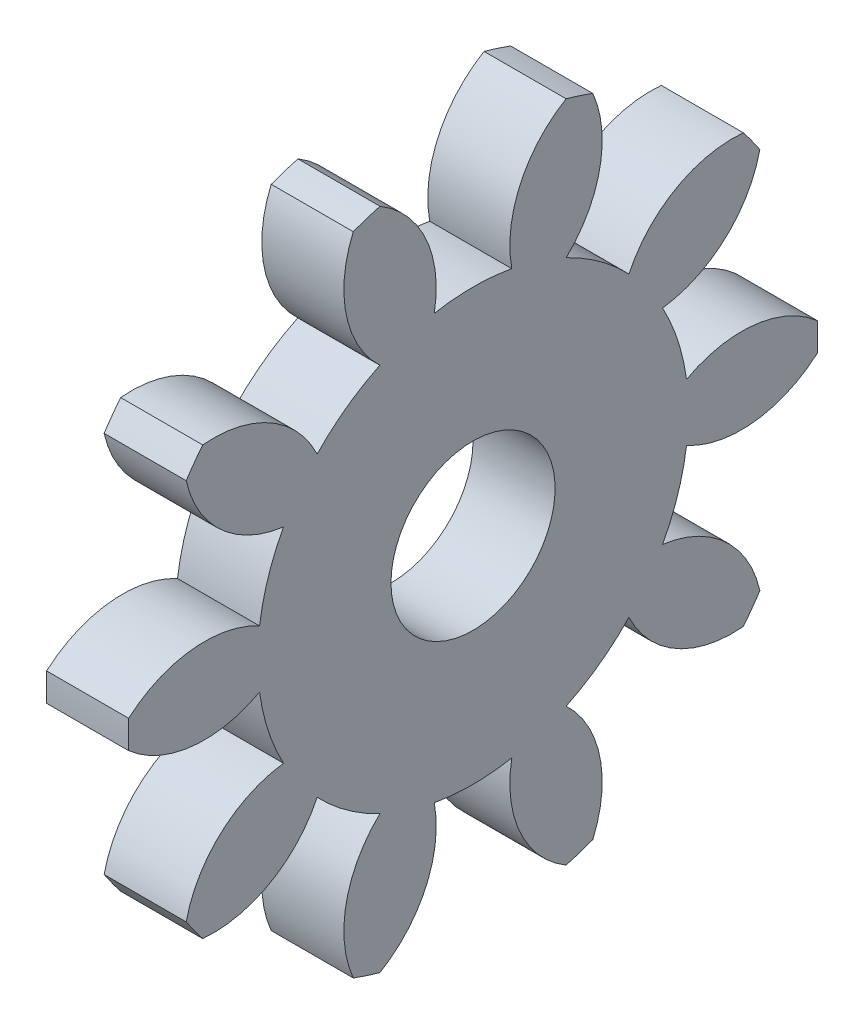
ISO-10303-21;
HEADER;
FILE_DESCRIPTION(('STEP AP214'),'2;1');
FILE_NAME('part.step','',(''),(''),'','','');
FILE_SCHEMA(('AUTOMOTIVE_DESIGN { 1 0 10303 214 1 1 1 1 }'));
ENDSEC;
DATA;
#1=APPLICATION_CONTEXT('core data for automotive mechanical design processes');
#2=APPLICATION_PROTOCOL_DEFINITION('international standard','automotive_design',2000,#1);
#3=PRODUCT_CONTEXT('',#1,'mechanical');
#4=PRODUCT('Part','Part','',(#3));
#5=PRODUCT_RELATED_PRODUCT_CATEGORY('part','',(#4));
#6=PRODUCT_DEFINITION_FORMATION('','',#4);
#7=PRODUCT_DEFINITION_CONTEXT('part definition',#1,'design');
#8=PRODUCT_DEFINITION('design','',#6,#7);
#9=PRODUCT_DEFINITION_SHAPE('','',#8);
#10=(LENGTH_UNIT() NAMED_UNIT(*) SI_UNIT(.MILLI.,.METRE.));
#11=(NAMED_UNIT(*) PLANE_ANGLE_UNIT() SI_UNIT($,.RADIAN.));
#12=(NAMED_UNIT(*) SI_UNIT($,.STERADIAN.) SOLID_ANGLE_UNIT());
#13=UNCERTAINTY_MEASURE_WITH_UNIT(LENGTH_MEASURE(1.E-05),#10,'distance_accuracy_value','');
#14=(GEOMETRIC_REPRESENTATION_CONTEXT(3) GLOBAL_UNCERTAINTY_ASSIGNED_CONTEXT((#13)) GLOBAL_UNIT_ASSIGNED_CONTEXT((#10,
#11,#12)) REPRESENTATION_CONTEXT('',''));
#15=CARTESIAN_POINT('',(0.,0.,0.));
#16=DIRECTION('',(0.,0.,1.));
#17=DIRECTION('',(1.,0.,0.));
#18=AXIS2_PLACEMENT_3D('',#15,#16,#17);
#19=CARTESIAN_POINT('',(5.,0.,0.));
#20=DIRECTION('',(-1.,0.,0.));
#21=DIRECTION('',(0.,0.,1.));
#22=AXIS2_PLACEMENT_3D('',#19,#20,#21);
#23=PLANE('',#22);
#24=CARTESIAN_POINT('',(5.,6.05558758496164,-15.8234320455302));
#25=DIRECTION('',(-1.,0.,0.));
#26=DIRECTION('',(0.,-0.587785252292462,-0.809016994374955));
#27=AXIS2_PLACEMENT_3D('',#24,#25,#26);
#28=CIRCLE('',#27,7.);
#29=CARTESIAN_POINT('',(5.,9.05584752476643,-9.49900003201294));
#30=VERTEX_POINT('',#29);
#31=CARTESIAN_POINT('',(5.,13.0254460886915,-16.4723329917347));
#32=VERTEX_POINT('',#31);
#33=EDGE_CURVE('E299',#30,#32,#28,.T.);
#34=ORIENTED_EDGE('',*,*,#33,.F.);
#35=CARTESIAN_POINT('',(5.,0.,0.));
#36=DIRECTION('',(-1.,0.,0.));
#37=DIRECTION('',(0.,-0.587785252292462,-0.809016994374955));
#38=AXIS2_PLACEMENT_3D('',#35,#36,#37);
#39=CIRCLE('',#38,13.124);
#40=CARTESIAN_POINT('',(5.,11.8324966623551,-5.67727035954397));
#41=VERTEX_POINT('',#40);
#42=EDGE_CURVE('E298',#41,#30,#39,.T.);
#43=ORIENTED_EDGE('',*,*,#42,.F.);
#44=CARTESIAN_POINT('',(5.,16.9202576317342,-0.869496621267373));
#45=DIRECTION('',(-1.,0.,0.));
#46=DIRECTION('',(0.,-0.587785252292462,-0.809016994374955));
#47=AXIS2_PLACEMENT_3D('',#44,#45,#46);
#48=CIRCLE('',#47,7.);
#49=CARTESIAN_POINT('',(5.,19.6912038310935,-7.29770454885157));
#50=VERTEX_POINT('',#49);
#51=EDGE_CURVE('E287',#50,#41,#48,.T.);
#52=ORIENTED_EDGE('',*,*,#51,.F.);
#53=CARTESIAN_POINT('',(5.,0.,0.));
#54=DIRECTION('',(-1.,0.,0.));
#55=DIRECTION('',(0.,0.,1.));
#56=AXIS2_PLACEMENT_3D('',#53,#54,#55);
#57=CIRCLE('',#56,21.);
#58=CARTESIAN_POINT('',(5.,20.2200016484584,-5.67023221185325));
#59=VERTEX_POINT('',#58);
#60=EDGE_CURVE('E522',#59,#50,#57,.T.);
#61=ORIENTED_EDGE('',*,*,#60,.F.);
#62=CARTESIAN_POINT('',(5.,14.1998532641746,-9.24204035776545));
#63=DIRECTION('',(-1.,0.,0.));
#64=DIRECTION('',(0.,0.,-1.));
#65=AXIS2_PLACEMENT_3D('',#62,#63,#64);
#66=CIRCLE('',#65,7.);
#67=CARTESIAN_POINT('',(5.,12.9097066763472,-2.3619588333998));
#68=VERTEX_POINT('',#67);
#69=EDGE_CURVE('E495',#68,#59,#66,.T.);
#70=ORIENTED_EDGE('',*,*,#69,.F.);
#71=CARTESIAN_POINT('',(5.,0.,0.));
#72=DIRECTION('',(-1.,0.,0.));
#73=DIRECTION('',(0.,0.,-1.));
#74=AXIS2_PLACEMENT_3D('',#71,#72,#73);
#75=CIRCLE('',#74,13.124);
#76=CARTESIAN_POINT('',(5.,12.9097066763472,2.3619588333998));
#77=VERTEX_POINT('',#76);
#78=EDGE_CURVE('E500',#77,#68,#75,.T.);
#79=ORIENTED_EDGE('',*,*,#78,.F.);
#80=CARTESIAN_POINT('',(5.,14.1998532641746,9.24204035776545));
#81=DIRECTION('',(-1.,0.,0.));
#82=DIRECTION('',(0.,0.,-1.));
#83=AXIS2_PLACEMENT_3D('',#80,#81,#82);
#84=CIRCLE('',#83,7.);
#85=CARTESIAN_POINT('',(5.,20.2200016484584,5.67023221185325));
#86=VERTEX_POINT('',#85);
#87=EDGE_CURVE('E497',#86,#77,#84,.T.);
#88=ORIENTED_EDGE('',*,*,#87,.F.);
#89=CARTESIAN_POINT('',(5.,19.6912038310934,7.29770454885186));
#90=VERTEX_POINT('',#89);
#91=EDGE_CURVE('E520',#90,#86,#57,.T.);
#92=ORIENTED_EDGE('',*,*,#91,.F.);
#93=CARTESIAN_POINT('',(5.,16.9202576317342,0.869496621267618));
#94=DIRECTION('',(-1.,0.,0.));
#95=DIRECTION('',(0.,0.587785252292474,-0.809016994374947));
#96=AXIS2_PLACEMENT_3D('',#93,#94,#95);
#97=CIRCLE('',#96,7.);
#98=CARTESIAN_POINT('',(5.,11.832496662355,5.67727035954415));
#99=VERTEX_POINT('',#98);
#100=EDGE_CURVE('E473',#99,#90,#97,.T.);
#101=ORIENTED_EDGE('',*,*,#100,.F.);
#102=CARTESIAN_POINT('',(5.,0.,0.));
#103=DIRECTION('',(-1.,0.,0.));
#104=DIRECTION('',(0.,0.587785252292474,-0.809016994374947));
#105=AXIS2_PLACEMENT_3D('',#102,#103,#104);
#106=CIRCLE('',#105,13.124);
#107=CARTESIAN_POINT('',(5.,9.05584752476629,9.49900003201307));
#108=VERTEX_POINT('',#107);
#109=EDGE_CURVE('E478',#108,#99,#106,.T.);
#110=ORIENTED_EDGE('',*,*,#109,.F.);
#111=CARTESIAN_POINT('',(5.,6.05558758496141,15.8234320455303));
#112=DIRECTION('',(-1.,0.,0.));
#113=DIRECTION('',(0.,0.587785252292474,-0.809016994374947));
#114=AXIS2_PLACEMENT_3D('',#111,#112,#113);
#115=CIRCLE('',#114,7.);
#116=CARTESIAN_POINT('',(5.,13.0254460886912,16.4723329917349));
#117=VERTEX_POINT('',#116);
#118=EDGE_CURVE('E475',#117,#108,#115,.T.);
#119=ORIENTED_EDGE('',*,*,#118,.F.);
#120=CARTESIAN_POINT('',(5.,11.6410354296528,17.4781662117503));
#121=VERTEX_POINT('',#120);
#122=EDGE_CURVE('E588',#121,#117,#57,.T.);
#123=ORIENTED_EDGE('',*,*,#122,.F.);
#124=CARTESIAN_POINT('',(5.,13.1776986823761,10.6489154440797));
#125=DIRECTION('',(-1.,0.,0.));
#126=DIRECTION('',(0.,0.951056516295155,-0.309016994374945));
#127=AXIS2_PLACEMENT_3D('',#124,#125,#126);
#128=CIRCLE('',#127,7.);
#129=CARTESIAN_POINT('',(5.,6.23567509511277,11.5479752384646));
#130=VERTEX_POINT('',#129);
#131=EDGE_CURVE('E451',#130,#121,#128,.T.);
#132=ORIENTED_EDGE('',*,*,#131,.F.);
#133=CARTESIAN_POINT('',(5.,0.,0.));
#134=DIRECTION('',(-1.,0.,0.));
#135=DIRECTION('',(0.,0.951056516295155,-0.309016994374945));
#136=AXIS2_PLACEMENT_3D('',#133,#134,#135);
#137=CIRCLE('',#136,13.124);
#138=CARTESIAN_POINT('',(5.,1.7429624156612,13.0077460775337));
#139=VERTEX_POINT('',#138);
#140=EDGE_CURVE('E456',#139,#130,#137,.T.);
#141=ORIENTED_EDGE('',*,*,#140,.F.);
#142=CARTESIAN_POINT('',(5.,-4.40170672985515,16.3608105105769));
#143=DIRECTION('',(-1.,0.,0.));
#144=DIRECTION('',(0.,0.951056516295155,-0.309016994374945));
#145=AXIS2_PLACEMENT_3D('',#142,#143,#144);
#146=CIRCLE('',#145,7.);
#147=CARTESIAN_POINT('',(5.,0.855612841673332,20.98256244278));
#148=VERTEX_POINT('',#147);
#149=EDGE_CURVE('E453',#148,#139,#146,.T.);
#150=ORIENTED_EDGE('',*,*,#149,.F.);
#151=CARTESIAN_POINT('',(5.,-0.855612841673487,20.98256244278));
#152=VERTEX_POINT('',#151);
#153=EDGE_CURVE('E583',#152,#148,#57,.T.);
#154=ORIENTED_EDGE('',*,*,#153,.F.);
#155=CARTESIAN_POINT('',(5.,4.40170672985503,16.3608105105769));
#156=DIRECTION('',(-1.,0.,0.));
#157=DIRECTION('',(0.,0.951056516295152,0.309016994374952));
#158=AXIS2_PLACEMENT_3D('',#155,#156,#157);
#159=CIRCLE('',#158,7.);
#160=CARTESIAN_POINT('',(5.,-1.7429624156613,13.0077460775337));
#161=VERTEX_POINT('',#160);
#162=EDGE_CURVE('E429',#161,#152,#159,.T.);
#163=ORIENTED_EDGE('',*,*,#162,.F.);
#164=CARTESIAN_POINT('',(5.,0.,0.));
#165=DIRECTION('',(-1.,0.,0.));
#166=DIRECTION('',(0.,0.951056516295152,0.309016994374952));
#167=AXIS2_PLACEMENT_3D('',#164,#165,#166);
#168=CIRCLE('',#167,13.124);
#169=CARTESIAN_POINT('',(5.,-6.23567509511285,11.5479752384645));
#170=VERTEX_POINT('',#169);
#171=EDGE_CURVE('E434',#170,#161,#168,.T.);
#172=ORIENTED_EDGE('',*,*,#171,.F.);
#173=CARTESIAN_POINT('',(5.,-13.1776986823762,10.6489154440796));
#174=DIRECTION('',(-1.,0.,0.));
#175=DIRECTION('',(0.,0.951056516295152,0.309016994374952));
#176=AXIS2_PLACEMENT_3D('',#173,#174,#175);
#177=CIRCLE('',#176,7.);
#178=CARTESIAN_POINT('',(5.,-11.6410354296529,17.4781662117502));
#179=VERTEX_POINT('',#178);
#180=EDGE_CURVE('E431',#179,#170,#177,.T.);
#181=ORIENTED_EDGE('',*,*,#180,.F.);
#182=CARTESIAN_POINT('',(5.,-13.0254460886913,16.4723329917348));
#183=VERTEX_POINT('',#182);
#184=EDGE_CURVE('E578',#183,#179,#57,.T.);
#185=ORIENTED_EDGE('',*,*,#184,.F.);
#186=CARTESIAN_POINT('',(5.,-6.05558758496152,15.8234320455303));
#187=DIRECTION('',(-1.,0.,0.));
#188=DIRECTION('',(0.,0.587785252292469,0.809016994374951));
#189=AXIS2_PLACEMENT_3D('',#186,#187,#188);
#190=CIRCLE('',#189,7.);
#191=CARTESIAN_POINT('',(5.,-9.05584752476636,9.49900003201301));
#192=VERTEX_POINT('',#191);
#193=EDGE_CURVE('E407',#192,#183,#190,.T.);
#194=ORIENTED_EDGE('',*,*,#193,.F.);
#195=CARTESIAN_POINT('',(5.,0.,0.));
#196=DIRECTION('',(-1.,0.,0.));
#197=DIRECTION('',(0.,0.587785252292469,0.809016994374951));
#198=AXIS2_PLACEMENT_3D('',#195,#196,#197);
#199=CIRCLE('',#198,13.124);
#200=CARTESIAN_POINT('',(5.,-11.832496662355,5.67727035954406));
#201=VERTEX_POINT('',#200);
#202=EDGE_CURVE('E412',#201,#192,#199,.T.);
#203=ORIENTED_EDGE('',*,*,#202,.F.);
#204=CARTESIAN_POINT('',(5.,-16.9202576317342,0.869496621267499));
#205=DIRECTION('',(-1.,0.,0.));
#206=DIRECTION('',(0.,0.587785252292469,0.809016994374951));
#207=AXIS2_PLACEMENT_3D('',#204,#205,#206);
#208=CIRCLE('',#207,7.);
#209=CARTESIAN_POINT('',(5.,-19.6912038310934,7.29770454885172));
#210=VERTEX_POINT('',#209);
#211=EDGE_CURVE('E409',#210,#201,#208,.T.);
#212=ORIENTED_EDGE('',*,*,#211,.F.);
#213=CARTESIAN_POINT('',(5.,-20.2200016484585,5.67023221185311));
#214=VERTEX_POINT('',#213);
#215=EDGE_CURVE('E573',#214,#210,#57,.T.);
#216=ORIENTED_EDGE('',*,*,#215,.F.);
#217=CARTESIAN_POINT('',(5.,-14.1998532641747,9.24204035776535));
#218=DIRECTION('',(-1.,0.,0.));
#219=DIRECTION('',(0.,0.,1.));
#220=AXIS2_PLACEMENT_3D('',#217,#218,#219);
#221=CIRCLE('',#220,7.);
#222=CARTESIAN_POINT('',(5.,-12.9097066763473,2.36195883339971));
#223=VERTEX_POINT('',#222);
#224=EDGE_CURVE('E385',#223,#214,#221,.T.);
#225=ORIENTED_EDGE('',*,*,#224,.F.);
#226=CARTESIAN_POINT('',(5.,0.,0.));
#227=DIRECTION('',(-1.,0.,0.));
#228=DIRECTION('',(0.,0.,1.));
#229=AXIS2_PLACEMENT_3D('',#226,#227,#228);
#230=CIRCLE('',#229,13.124);
#231=CARTESIAN_POINT('',(5.,-12.9097066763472,-2.36195883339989));
#232=VERTEX_POINT('',#231);
#233=EDGE_CURVE('E390',#232,#223,#230,.T.);
#234=ORIENTED_EDGE('',*,*,#233,.F.);
#235=CARTESIAN_POINT('',(5.,-14.1998532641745,-9.24204035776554));
#236=DIRECTION('',(-1.,0.,0.));
#237=DIRECTION('',(0.,0.,1.));
#238=AXIS2_PLACEMENT_3D('',#235,#236,#237);
#239=CIRCLE('',#238,7.);
#240=CARTESIAN_POINT('',(5.,-20.2200016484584,-5.67023221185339));
#241=VERTEX_POINT('',#240);
#242=EDGE_CURVE('E387',#241,#232,#239,.T.);
#243=ORIENTED_EDGE('',*,*,#242,.F.);
#244=CARTESIAN_POINT('',(5.,-19.6912038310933,-7.29770454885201));
#245=VERTEX_POINT('',#244);
#246=EDGE_CURVE('E568',#245,#241,#57,.T.);
#247=ORIENTED_EDGE('',*,*,#246,.F.);
#248=CARTESIAN_POINT('',(5.,-16.9202576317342,-0.869496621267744));
#249=DIRECTION('',(-1.,0.,0.));
#250=DIRECTION('',(0.,-0.58778525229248,0.809016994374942));
#251=AXIS2_PLACEMENT_3D('',#248,#249,#250);
#252=CIRCLE('',#251,7.);
#253=CARTESIAN_POINT('',(5.,-11.8324966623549,-5.67727035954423));
#254=VERTEX_POINT('',#253);
#255=EDGE_CURVE('E363',#254,#245,#252,.T.);
#256=ORIENTED_EDGE('',*,*,#255,.F.);
#257=CARTESIAN_POINT('',(5.,0.,0.));
#258=DIRECTION('',(-1.,0.,0.));
#259=DIRECTION('',(0.,-0.58778525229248,0.809016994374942));
#260=AXIS2_PLACEMENT_3D('',#257,#258,#259);
#261=CIRCLE('',#260,13.124);
#262=CARTESIAN_POINT('',(5.,-9.05584752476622,-9.49900003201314));
#263=VERTEX_POINT('',#262);
#264=EDGE_CURVE('E368',#263,#254,#261,.T.);
#265=ORIENTED_EDGE('',*,*,#264,.F.);
#266=CARTESIAN_POINT('',(5.,-6.05558758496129,-15.8234320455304));
#267=DIRECTION('',(-1.,0.,0.));
#268=DIRECTION('',(0.,-0.58778525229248,0.809016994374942));
#269=AXIS2_PLACEMENT_3D('',#266,#267,#268);
#270=CIRCLE('',#269,7.);
#271=CARTESIAN_POINT('',(5.,-13.0254460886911,-16.472332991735));
#272=VERTEX_POINT('',#271);
#273=EDGE_CURVE('E365',#272,#263,#270,.T.);
#274=ORIENTED_EDGE('',*,*,#273,.F.);
#275=CARTESIAN_POINT('',(5.,-11.6410354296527,-17.4781662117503));
#276=VERTEX_POINT('',#275);
#277=EDGE_CURVE('E563',#276,#272,#57,.T.);
#278=ORIENTED_EDGE('',*,*,#277,.F.);
#279=CARTESIAN_POINT('',(5.,-13.177698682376,-10.6489154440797));
#280=DIRECTION('',(-1.,0.,0.));
#281=DIRECTION('',(0.,-0.951056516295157,0.309016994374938));
#282=AXIS2_PLACEMENT_3D('',#279,#280,#281);
#283=CIRCLE('',#282,7.);
#284=CARTESIAN_POINT('',(5.,-6.23567509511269,-11.5479752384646));
#285=VERTEX_POINT('',#284);
#286=EDGE_CURVE('E341',#285,#276,#283,.T.);
#287=ORIENTED_EDGE('',*,*,#286,.F.);
#288=CARTESIAN_POINT('',(5.,0.,0.));
#289=DIRECTION('',(-1.,0.,0.));
#290=DIRECTION('',(0.,-0.951056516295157,0.309016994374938));
#291=AXIS2_PLACEMENT_3D('',#288,#289,#290);
#292=CIRCLE('',#291,13.124);
#293=CARTESIAN_POINT('',(5.,-1.74296241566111,-13.0077460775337));
#294=VERTEX_POINT('',#293);
#295=EDGE_CURVE('E346',#294,#285,#292,.T.);
#296=ORIENTED_EDGE('',*,*,#295,.F.);
#297=CARTESIAN_POINT('',(5.,4.40170672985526,-16.3608105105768));
#298=DIRECTION('',(-1.,0.,0.));
#299=DIRECTION('',(0.,-0.951056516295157,0.309016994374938));
#300=AXIS2_PLACEMENT_3D('',#297,#298,#299);
#301=CIRCLE('',#300,7.);
#302=CARTESIAN_POINT('',(5.,-0.855612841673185,-20.9825624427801));
#303=VERTEX_POINT('',#302);
#304=EDGE_CURVE('E343',#303,#294,#301,.T.);
#305=ORIENTED_EDGE('',*,*,#304,.F.);
#306=CARTESIAN_POINT('',(5.,0.855612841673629,-20.98256244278));
#307=VERTEX_POINT('',#306);
#308=EDGE_CURVE('E562',#307,#303,#57,.T.);
#309=ORIENTED_EDGE('',*,*,#308,.F.);
#310=CARTESIAN_POINT('',(5.,-4.40170672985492,-16.3608105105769));
#311=DIRECTION('',(-1.,0.,0.));
#312=DIRECTION('',(0.,-0.95105651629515,-0.309016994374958));
#313=AXIS2_PLACEMENT_3D('',#310,#311,#312);
#314=CIRCLE('',#313,7.);
#315=CARTESIAN_POINT('',(5.,1.74296241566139,-13.0077460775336));
#316=VERTEX_POINT('',#315);
#317=EDGE_CURVE('E321',#316,#307,#314,.T.);
#318=ORIENTED_EDGE('',*,*,#317,.F.);
#319=CARTESIAN_POINT('',(5.,0.,0.));
#320=DIRECTION('',(-1.,0.,0.));
#321=DIRECTION('',(0.,-0.95105651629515,-0.309016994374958));
#322=AXIS2_PLACEMENT_3D('',#319,#320,#321);
#323=CIRCLE('',#322,13.124);
#324=CARTESIAN_POINT('',(5.,6.23567509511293,-11.5479752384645));
#325=VERTEX_POINT('',#324);
#326=EDGE_CURVE('E326',#325,#316,#323,.T.);
#327=ORIENTED_EDGE('',*,*,#326,.F.);
#328=CARTESIAN_POINT('',(5.,13.1776986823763,-10.6489154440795));
#329=DIRECTION('',(-1.,0.,0.));
#330=DIRECTION('',(0.,-0.95105651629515,-0.309016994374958));
#331=AXIS2_PLACEMENT_3D('',#328,#329,#330);
#332=CIRCLE('',#331,7.);
#333=CARTESIAN_POINT('',(5.,11.641035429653,-17.4781662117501));
#334=VERTEX_POINT('',#333);
#335=EDGE_CURVE('E323',#334,#325,#332,.T.);
#336=ORIENTED_EDGE('',*,*,#335,.F.);
#337=EDGE_CURVE('E525',#32,#334,#57,.T.);
#338=ORIENTED_EDGE('',*,*,#337,.F.);
#339=EDGE_LOOP('',(#34,#43,#52,#61,#70,#79,#88,#92,#101,#110,#119,#123,#132,#141,#150,#154,#163,
#172,#181,#185,#194,#203,#212,#216,#225,#234,#243,#247,#256,#265,#274,#278,#287,#296,#305,#309,
#318,#327,#336,#338));
#340=FACE_BOUND('',#339,.T.);
#341=CARTESIAN_POINT('',(5.,0.,0.));
#342=DIRECTION('',(-1.,0.,0.));
#343=DIRECTION('',(0.,0.,1.));
#344=AXIS2_PLACEMENT_3D('',#341,#342,#343);
#345=CIRCLE('',#344,5.);
#346=CARTESIAN_POINT('',(5.,0.,5.));
#347=VERTEX_POINT('',#346);
#348=EDGE_CURVE('E316',#347,#347,#345,.F.);
#349=ORIENTED_EDGE('',*,*,#348,.F.);
#350=EDGE_LOOP('',(#349));
#351=FACE_BOUND('',#350,.T.);
#352=ADVANCED_FACE('F30',(#340,#351),#23,.F.);
#353=CARTESIAN_POINT('',(0.,0.,0.));
#354=DIRECTION('',(1.,0.,0.));
#355=DIRECTION('',(0.,0.,-1.));
#356=AXIS2_PLACEMENT_3D('',#353,#354,#355);
#357=PLANE('',#356);
#358=CARTESIAN_POINT('',(0.,6.05558758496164,-15.8234320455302));
#359=DIRECTION('',(-1.,0.,0.));
#360=DIRECTION('',(0.,-0.587785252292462,-0.809016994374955));
#361=AXIS2_PLACEMENT_3D('',#358,#359,#360);
#362=CIRCLE('',#361,7.);
#363=CARTESIAN_POINT('',(0.,9.05584752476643,-9.49900003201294));
#364=VERTEX_POINT('',#363);
#365=CARTESIAN_POINT('',(0.,13.0254460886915,-16.4723329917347));
#366=VERTEX_POINT('',#365);
#367=EDGE_CURVE('E45',#364,#366,#362,.T.);
#368=ORIENTED_EDGE('',*,*,#367,.T.);
#369=CARTESIAN_POINT('',(0.,0.,0.));
#370=DIRECTION('',(-1.,0.,0.));
#371=DIRECTION('',(0.,0.,1.));
#372=AXIS2_PLACEMENT_3D('',#369,#370,#371);
#373=CIRCLE('',#372,21.);
#374=CARTESIAN_POINT('',(0.,11.641035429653,-17.4781662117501));
#375=VERTEX_POINT('',#374);
#376=EDGE_CURVE('E521',#366,#375,#373,.T.);
#377=ORIENTED_EDGE('',*,*,#376,.T.);
#378=CARTESIAN_POINT('',(0.,13.1776986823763,-10.6489154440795));
#379=DIRECTION('',(1.,0.,0.));
#380=DIRECTION('',(0.,0.,-1.));
#381=AXIS2_PLACEMENT_3D('',#378,#379,#380);
#382=CIRCLE('',#381,7.);
#383=CARTESIAN_POINT('',(0.,6.23567509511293,-11.5479752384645));
#384=VERTEX_POINT('',#383);
#385=EDGE_CURVE('E38',#384,#375,#382,.T.);
#386=ORIENTED_EDGE('',*,*,#385,.F.);
#387=CARTESIAN_POINT('',(0.,0.,0.));
#388=DIRECTION('',(-1.,0.,0.));
#389=DIRECTION('',(0.,-0.95105651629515,-0.309016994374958));
#390=AXIS2_PLACEMENT_3D('',#387,#388,#389);
#391=CIRCLE('',#390,13.124);
#392=CARTESIAN_POINT('',(0.,1.74296241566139,-13.0077460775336));
#393=VERTEX_POINT('',#392);
#394=EDGE_CURVE('E324',#384,#393,#391,.T.);
#395=ORIENTED_EDGE('',*,*,#394,.T.);
#396=CARTESIAN_POINT('',(0.,-4.40170672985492,-16.3608105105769));
#397=DIRECTION('',(-1.,0.,0.));
#398=DIRECTION('',(0.,-0.95105651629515,-0.309016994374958));
#399=AXIS2_PLACEMENT_3D('',#396,#397,#398);
#400=CIRCLE('',#399,7.);
#401=CARTESIAN_POINT('',(0.,0.855612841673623,-20.98256244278));
#402=VERTEX_POINT('',#401);
#403=EDGE_CURVE('E53',#393,#402,#400,.T.);
#404=ORIENTED_EDGE('',*,*,#403,.T.);
#405=CARTESIAN_POINT('',(0.,-0.855612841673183,-20.9825624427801));
#406=VERTEX_POINT('',#405);
#407=EDGE_CURVE('E755',#402,#406,#373,.T.);
#408=ORIENTED_EDGE('',*,*,#407,.T.);
#409=CARTESIAN_POINT('',(0.,4.40170672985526,-16.3608105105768));
#410=DIRECTION('',(1.,0.,0.));
#411=DIRECTION('',(0.,0.,-1.));
#412=AXIS2_PLACEMENT_3D('',#409,#410,#411);
#413=CIRCLE('',#412,7.);
#414=CARTESIAN_POINT('',(0.,-1.74296241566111,-13.0077460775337));
#415=VERTEX_POINT('',#414);
#416=EDGE_CURVE('E546',#415,#406,#413,.T.);
#417=ORIENTED_EDGE('',*,*,#416,.F.);
#418=CARTESIAN_POINT('',(0.,0.,0.));
#419=DIRECTION('',(-1.,0.,0.));
#420=DIRECTION('',(0.,-0.951056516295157,0.309016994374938));
#421=AXIS2_PLACEMENT_3D('',#418,#419,#420);
#422=CIRCLE('',#421,13.124);
#423=CARTESIAN_POINT('',(0.,-6.23567509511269,-11.5479752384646));
#424=VERTEX_POINT('',#423);
#425=EDGE_CURVE('E344',#415,#424,#422,.T.);
#426=ORIENTED_EDGE('',*,*,#425,.T.);
#427=CARTESIAN_POINT('',(0.,-13.177698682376,-10.6489154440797));
#428=DIRECTION('',(-1.,0.,0.));
#429=DIRECTION('',(0.,-0.951056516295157,0.309016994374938));
#430=AXIS2_PLACEMENT_3D('',#427,#428,#429);
#431=CIRCLE('',#430,7.);
#432=CARTESIAN_POINT('',(0.,-11.6410354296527,-17.4781662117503));
#433=VERTEX_POINT('',#432);
#434=EDGE_CURVE('E340',#424,#433,#431,.T.);
#435=ORIENTED_EDGE('',*,*,#434,.T.);
#436=CARTESIAN_POINT('',(0.,-13.0254460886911,-16.472332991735));
#437=VERTEX_POINT('',#436);
#438=EDGE_CURVE('E756',#433,#437,#373,.T.);
#439=ORIENTED_EDGE('',*,*,#438,.T.);
#440=CARTESIAN_POINT('',(0.,-6.05558758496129,-15.8234320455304));
#441=DIRECTION('',(1.,0.,0.));
#442=DIRECTION('',(0.,0.,-1.));
#443=AXIS2_PLACEMENT_3D('',#440,#441,#442);
#444=CIRCLE('',#443,7.);
#445=CARTESIAN_POINT('',(0.,-9.05584752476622,-9.49900003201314));
#446=VERTEX_POINT('',#445);
#447=EDGE_CURVE('E543',#446,#437,#444,.T.);
#448=ORIENTED_EDGE('',*,*,#447,.F.);
#449=CARTESIAN_POINT('',(0.,0.,0.));
#450=DIRECTION('',(-1.,0.,0.));
#451=DIRECTION('',(0.,-0.58778525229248,0.809016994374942));
#452=AXIS2_PLACEMENT_3D('',#449,#450,#451);
#453=CIRCLE('',#452,13.124);
#454=CARTESIAN_POINT('',(0.,-11.8324966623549,-5.67727035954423));
#455=VERTEX_POINT('',#454);
#456=EDGE_CURVE('E366',#446,#455,#453,.T.);
#457=ORIENTED_EDGE('',*,*,#456,.T.);
#458=CARTESIAN_POINT('',(0.,-16.9202576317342,-0.869496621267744));
#459=DIRECTION('',(-1.,0.,0.));
#460=DIRECTION('',(0.,-0.58778525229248,0.809016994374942));
#461=AXIS2_PLACEMENT_3D('',#458,#459,#460);
#462=CIRCLE('',#461,7.);
#463=CARTESIAN_POINT('',(0.,-19.6912038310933,-7.29770454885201));
#464=VERTEX_POINT('',#463);
#465=EDGE_CURVE('E362',#455,#464,#462,.T.);
#466=ORIENTED_EDGE('',*,*,#465,.T.);
#467=CARTESIAN_POINT('',(0.,-20.2200016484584,-5.6702322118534));
#468=VERTEX_POINT('',#467);
#469=EDGE_CURVE('E759',#464,#468,#373,.T.);
#470=ORIENTED_EDGE('',*,*,#469,.T.);
#471=CARTESIAN_POINT('',(0.,-14.1998532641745,-9.24204035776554));
#472=DIRECTION('',(1.,0.,0.));
#473=DIRECTION('',(0.,0.,-1.));
#474=AXIS2_PLACEMENT_3D('',#471,#472,#473);
#475=CIRCLE('',#474,7.);
#476=CARTESIAN_POINT('',(0.,-12.9097066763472,-2.36195883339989));
#477=VERTEX_POINT('',#476);
#478=EDGE_CURVE('E540',#477,#468,#475,.T.);
#479=ORIENTED_EDGE('',*,*,#478,.F.);
#480=CARTESIAN_POINT('',(0.,0.,0.));
#481=DIRECTION('',(-1.,0.,0.));
#482=DIRECTION('',(0.,0.,1.));
#483=AXIS2_PLACEMENT_3D('',#480,#481,#482);
#484=CIRCLE('',#483,13.124);
#485=CARTESIAN_POINT('',(0.,-12.9097066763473,2.36195883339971));
#486=VERTEX_POINT('',#485);
#487=EDGE_CURVE('E388',#477,#486,#484,.T.);
#488=ORIENTED_EDGE('',*,*,#487,.T.);
#489=CARTESIAN_POINT('',(0.,-14.1998532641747,9.24204035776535));
#490=DIRECTION('',(-1.,0.,0.));
#491=DIRECTION('',(0.,0.,1.));
#492=AXIS2_PLACEMENT_3D('',#489,#490,#491);
#493=CIRCLE('',#492,7.);
#494=CARTESIAN_POINT('',(0.,-20.2200016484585,5.67023221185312));
#495=VERTEX_POINT('',#494);
#496=EDGE_CURVE('E384',#486,#495,#493,.T.);
#497=ORIENTED_EDGE('',*,*,#496,.T.);
#498=CARTESIAN_POINT('',(0.,-19.6912038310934,7.29770454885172));
#499=VERTEX_POINT('',#498);
#500=EDGE_CURVE('E762',#495,#499,#373,.T.);
#501=ORIENTED_EDGE('',*,*,#500,.T.);
#502=CARTESIAN_POINT('',(0.,-16.9202576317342,0.869496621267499));
#503=DIRECTION('',(1.,0.,0.));
#504=DIRECTION('',(0.,0.,-1.));
#505=AXIS2_PLACEMENT_3D('',#502,#503,#504);
#506=CIRCLE('',#505,7.);
#507=CARTESIAN_POINT('',(0.,-11.832496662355,5.67727035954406));
#508=VERTEX_POINT('',#507);
#509=EDGE_CURVE('E537',#508,#499,#506,.T.);
#510=ORIENTED_EDGE('',*,*,#509,.F.);
#511=CARTESIAN_POINT('',(0.,0.,0.));
#512=DIRECTION('',(-1.,0.,0.));
#513=DIRECTION('',(0.,0.587785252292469,0.809016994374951));
#514=AXIS2_PLACEMENT_3D('',#511,#512,#513);
#515=CIRCLE('',#514,13.124);
#516=CARTESIAN_POINT('',(0.,-9.05584752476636,9.49900003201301));
#517=VERTEX_POINT('',#516);
#518=EDGE_CURVE('E410',#508,#517,#515,.T.);
#519=ORIENTED_EDGE('',*,*,#518,.T.);
#520=CARTESIAN_POINT('',(0.,-6.05558758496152,15.8234320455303));
#521=DIRECTION('',(-1.,0.,0.));
#522=DIRECTION('',(0.,0.587785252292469,0.809016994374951));
#523=AXIS2_PLACEMENT_3D('',#520,#521,#522);
#524=CIRCLE('',#523,7.);
#525=CARTESIAN_POINT('',(0.,-13.0254460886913,16.4723329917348));
#526=VERTEX_POINT('',#525);
#527=EDGE_CURVE('E406',#517,#526,#524,.T.);
#528=ORIENTED_EDGE('',*,*,#527,.T.);
#529=CARTESIAN_POINT('',(0.,-11.6410354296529,17.4781662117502));
#530=VERTEX_POINT('',#529);
#531=EDGE_CURVE('E765',#526,#530,#373,.T.);
#532=ORIENTED_EDGE('',*,*,#531,.T.);
#533=CARTESIAN_POINT('',(0.,-13.1776986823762,10.6489154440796));
#534=DIRECTION('',(1.,0.,0.));
#535=DIRECTION('',(0.,0.,-1.));
#536=AXIS2_PLACEMENT_3D('',#533,#534,#535);
#537=CIRCLE('',#536,7.);
#538=CARTESIAN_POINT('',(0.,-6.23567509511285,11.5479752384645));
#539=VERTEX_POINT('',#538);
#540=EDGE_CURVE('E534',#539,#530,#537,.T.);
#541=ORIENTED_EDGE('',*,*,#540,.F.);
#542=CARTESIAN_POINT('',(0.,0.,0.));
#543=DIRECTION('',(-1.,0.,0.));
#544=DIRECTION('',(0.,0.951056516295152,0.309016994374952));
#545=AXIS2_PLACEMENT_3D('',#542,#543,#544);
#546=CIRCLE('',#545,13.124);
#547=CARTESIAN_POINT('',(0.,-1.74296241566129,13.0077460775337));
#548=VERTEX_POINT('',#547);
#549=EDGE_CURVE('E432',#539,#548,#546,.T.);
#550=ORIENTED_EDGE('',*,*,#549,.T.);
#551=CARTESIAN_POINT('',(0.,4.40170672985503,16.3608105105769));
#552=DIRECTION('',(-1.,0.,0.));
#553=DIRECTION('',(0.,0.951056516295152,0.309016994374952));
#554=AXIS2_PLACEMENT_3D('',#551,#552,#553);
#555=CIRCLE('',#554,7.);
#556=CARTESIAN_POINT('',(0.,-0.85561284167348,20.98256244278));
#557=VERTEX_POINT('',#556);
#558=EDGE_CURVE('E428',#548,#557,#555,.T.);
#559=ORIENTED_EDGE('',*,*,#558,.T.);
#560=CARTESIAN_POINT('',(0.,0.855612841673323,20.9825624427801));
#561=VERTEX_POINT('',#560);
#562=EDGE_CURVE('E768',#557,#561,#373,.T.);
#563=ORIENTED_EDGE('',*,*,#562,.T.);
#564=CARTESIAN_POINT('',(0.,-4.40170672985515,16.3608105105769));
#565=DIRECTION('',(1.,0.,0.));
#566=DIRECTION('',(0.,0.,-1.));
#567=AXIS2_PLACEMENT_3D('',#564,#565,#566);
#568=CIRCLE('',#567,7.);
#569=CARTESIAN_POINT('',(0.,1.7429624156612,13.0077460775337));
#570=VERTEX_POINT('',#569);
#571=EDGE_CURVE('E531',#570,#561,#568,.T.);
#572=ORIENTED_EDGE('',*,*,#571,.F.);
#573=CARTESIAN_POINT('',(0.,0.,0.));
#574=DIRECTION('',(-1.,0.,0.));
#575=DIRECTION('',(0.,0.951056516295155,-0.309016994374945));
#576=AXIS2_PLACEMENT_3D('',#573,#574,#575);
#577=CIRCLE('',#576,13.124);
#578=CARTESIAN_POINT('',(0.,6.23567509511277,11.5479752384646));
#579=VERTEX_POINT('',#578);
#580=EDGE_CURVE('E454',#570,#579,#577,.T.);
#581=ORIENTED_EDGE('',*,*,#580,.T.);
#582=CARTESIAN_POINT('',(0.,13.1776986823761,10.6489154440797));
#583=DIRECTION('',(-1.,0.,0.));
#584=DIRECTION('',(0.,0.951056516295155,-0.309016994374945));
#585=AXIS2_PLACEMENT_3D('',#582,#583,#584);
#586=CIRCLE('',#585,7.);
#587=CARTESIAN_POINT('',(0.,11.6410354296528,17.4781662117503));
#588=VERTEX_POINT('',#587);
#589=EDGE_CURVE('E450',#579,#588,#586,.T.);
#590=ORIENTED_EDGE('',*,*,#589,.T.);
#591=CARTESIAN_POINT('',(0.,13.0254460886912,16.4723329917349));
#592=VERTEX_POINT('',#591);
#593=EDGE_CURVE('E771',#588,#592,#373,.T.);
#594=ORIENTED_EDGE('',*,*,#593,.T.);
#595=CARTESIAN_POINT('',(0.,6.05558758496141,15.8234320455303));
#596=DIRECTION('',(1.,0.,0.));
#597=DIRECTION('',(0.,0.,-1.));
#598=AXIS2_PLACEMENT_3D('',#595,#596,#597);
#599=CIRCLE('',#598,7.);
#600=CARTESIAN_POINT('',(0.,9.05584752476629,9.49900003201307));
#601=VERTEX_POINT('',#600);
#602=EDGE_CURVE('E528',#601,#592,#599,.T.);
#603=ORIENTED_EDGE('',*,*,#602,.F.);
#604=CARTESIAN_POINT('',(0.,0.,0.));
#605=DIRECTION('',(-1.,0.,0.));
#606=DIRECTION('',(0.,0.587785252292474,-0.809016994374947));
#607=AXIS2_PLACEMENT_3D('',#604,#605,#606);
#608=CIRCLE('',#607,13.124);
#609=CARTESIAN_POINT('',(0.,11.832496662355,5.67727035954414));
#610=VERTEX_POINT('',#609);
#611=EDGE_CURVE('E476',#601,#610,#608,.T.);
#612=ORIENTED_EDGE('',*,*,#611,.T.);
#613=CARTESIAN_POINT('',(0.,16.9202576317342,0.869496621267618));
#614=DIRECTION('',(-1.,0.,0.));
#615=DIRECTION('',(0.,0.587785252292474,-0.809016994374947));
#616=AXIS2_PLACEMENT_3D('',#613,#614,#615);
#617=CIRCLE('',#616,7.);
#618=CARTESIAN_POINT('',(0.,19.6912038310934,7.29770454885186));
#619=VERTEX_POINT('',#618);
#620=EDGE_CURVE('E472',#610,#619,#617,.T.);
#621=ORIENTED_EDGE('',*,*,#620,.T.);
#622=CARTESIAN_POINT('',(0.,20.2200016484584,5.67023221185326));
#623=VERTEX_POINT('',#622);
#624=EDGE_CURVE('E516',#619,#623,#373,.T.);
#625=ORIENTED_EDGE('',*,*,#624,.T.);
#626=CARTESIAN_POINT('',(0.,14.1998532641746,9.24204035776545));
#627=DIRECTION('',(1.,0.,0.));
#628=DIRECTION('',(0.,0.,-1.));
#629=AXIS2_PLACEMENT_3D('',#626,#627,#628);
#630=CIRCLE('',#629,7.);
#631=CARTESIAN_POINT('',(0.,12.9097066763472,2.3619588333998));
#632=VERTEX_POINT('',#631);
#633=EDGE_CURVE('E524',#632,#623,#630,.T.);
#634=ORIENTED_EDGE('',*,*,#633,.F.);
#635=CARTESIAN_POINT('',(0.,0.,0.));
#636=DIRECTION('',(-1.,0.,0.));
#637=DIRECTION('',(0.,0.,-1.));
#638=AXIS2_PLACEMENT_3D('',#635,#636,#637);
#639=CIRCLE('',#638,13.124);
#640=CARTESIAN_POINT('',(0.,12.9097066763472,-2.3619588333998));
#641=VERTEX_POINT('',#640);
#642=EDGE_CURVE('E498',#632,#641,#639,.T.);
#643=ORIENTED_EDGE('',*,*,#642,.T.);
#644=CARTESIAN_POINT('',(0.,14.1998532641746,-9.24204035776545));
#645=DIRECTION('',(-1.,0.,0.));
#646=DIRECTION('',(0.,0.,-1.));
#647=AXIS2_PLACEMENT_3D('',#644,#645,#646);
#648=CIRCLE('',#647,7.);
#649=CARTESIAN_POINT('',(0.,20.2200016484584,-5.67023221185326));
#650=VERTEX_POINT('',#649);
#651=EDGE_CURVE('E494',#641,#650,#648,.T.);
#652=ORIENTED_EDGE('',*,*,#651,.T.);
#653=CARTESIAN_POINT('',(0.,19.6912038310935,-7.29770454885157));
#654=VERTEX_POINT('',#653);
#655=EDGE_CURVE('E517',#650,#654,#373,.T.);
#656=ORIENTED_EDGE('',*,*,#655,.T.);
#657=CARTESIAN_POINT('',(0.,16.9202576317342,-0.869496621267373));
#658=DIRECTION('',(1.,0.,0.));
#659=DIRECTION('',(0.,0.,-1.));
#660=AXIS2_PLACEMENT_3D('',#657,#658,#659);
#661=CIRCLE('',#660,7.);
#662=CARTESIAN_POINT('',(0.,11.8324966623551,-5.67727035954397));
#663=VERTEX_POINT('',#662);
#664=EDGE_CURVE('E11',#663,#654,#661,.T.);
#665=ORIENTED_EDGE('',*,*,#664,.F.);
#666=CARTESIAN_POINT('',(0.,0.,0.));
#667=DIRECTION('',(-1.,0.,0.));
#668=DIRECTION('',(0.,-0.587785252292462,-0.809016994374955));
#669=AXIS2_PLACEMENT_3D('',#666,#667,#668);
#670=CIRCLE('',#669,13.124);
#671=EDGE_CURVE('E304',#663,#364,#670,.T.);
#672=ORIENTED_EDGE('',*,*,#671,.T.);
#673=EDGE_LOOP('',(#368,#377,#386,#395,#404,#408,#417,#426,#435,#439,#448,#457,#466,#470,#479,
#488,#497,#501,#510,#519,#528,#532,#541,#550,#559,#563,#572,#581,#590,#594,#603,#612,#621,#625,
#634,#643,#652,#656,#665,#672));
#674=FACE_BOUND('',#673,.T.);
#675=CARTESIAN_POINT('',(0.,0.,0.));
#676=DIRECTION('',(1.,0.,0.));
#677=DIRECTION('',(0.,0.,-1.));
#678=AXIS2_PLACEMENT_3D('',#675,#676,#677);
#679=CIRCLE('',#678,5.);
#680=CARTESIAN_POINT('',(0.,0.,-5.));
#681=VERTEX_POINT('',#680);
#682=EDGE_CURVE('E33',#681,#681,#679,.F.);
#683=ORIENTED_EDGE('',*,*,#682,.F.);
#684=EDGE_LOOP('',(#683));
#685=FACE_BOUND('',#684,.T.);
#686=ADVANCED_FACE('F619',(#674,#685),#357,.F.);
#687=CARTESIAN_POINT('',(-10.,0.,0.));
#688=DIRECTION('',(-1.,0.,0.));
#689=DIRECTION('',(0.,0.,1.));
#690=AXIS2_PLACEMENT_3D('',#687,#688,#689);
#691=CYLINDRICAL_SURFACE('',#690,21.);
#692=DIRECTION('',(-1.,0.,0.));
#693=VECTOR('',#692,1.);
#694=CARTESIAN_POINT('',(2.5,13.0254460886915,-16.4723329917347));
#695=LINE('',#694,#693);
#696=EDGE_CURVE('E319',#32,#366,#695,.T.);
#697=ORIENTED_EDGE('',*,*,#696,.F.);
#698=ORIENTED_EDGE('',*,*,#337,.T.);
#699=DIRECTION('',(-1.,0.,0.));
#700=VECTOR('',#699,1.);
#701=CARTESIAN_POINT('',(2.5,11.641035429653,-17.4781662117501));
#702=LINE('',#701,#700);
#703=EDGE_CURVE('E335',#375,#334,#702,.F.);
#704=ORIENTED_EDGE('',*,*,#703,.F.);
#705=ORIENTED_EDGE('',*,*,#376,.F.);
#706=EDGE_LOOP('',(#697,#698,#704,#705));
#707=FACE_BOUND('',#706,.T.);
#708=ADVANCED_FACE('F561',(#707),#691,.T.);
#709=DIRECTION('',(-1.,0.,0.));
#710=VECTOR('',#709,1.);
#711=CARTESIAN_POINT('',(2.5,19.6912038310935,-7.29770454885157));
#712=LINE('',#711,#710);
#713=EDGE_CURVE('E293',#654,#50,#712,.F.);
#714=ORIENTED_EDGE('',*,*,#713,.F.);
#715=ORIENTED_EDGE('',*,*,#655,.F.);
#716=DIRECTION('',(-1.,0.,0.));
#717=VECTOR('',#716,1.);
#718=CARTESIAN_POINT('',(2.5,20.2200016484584,-5.67023221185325));
#719=LINE('',#718,#717);
#720=EDGE_CURVE('E514',#59,#650,#719,.T.);
#721=ORIENTED_EDGE('',*,*,#720,.F.);
#722=ORIENTED_EDGE('',*,*,#60,.T.);
#723=EDGE_LOOP('',(#714,#715,#721,#722));
#724=FACE_BOUND('',#723,.T.);
#725=ADVANCED_FACE('F622',(#724),#691,.T.);
#726=DIRECTION('',(-1.,0.,0.));
#727=VECTOR('',#726,1.);
#728=CARTESIAN_POINT('',(2.5,0.855612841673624,-20.98256244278));
#729=LINE('',#728,#727);
#730=EDGE_CURVE('E338',#307,#402,#729,.T.);
#731=ORIENTED_EDGE('',*,*,#730,.F.);
#732=ORIENTED_EDGE('',*,*,#308,.T.);
#733=DIRECTION('',(-1.,0.,0.));
#734=VECTOR('',#733,1.);
#735=CARTESIAN_POINT('',(2.5,-0.855612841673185,-20.9825624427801));
#736=LINE('',#735,#734);
#737=EDGE_CURVE('E357',#406,#303,#736,.F.);
#738=ORIENTED_EDGE('',*,*,#737,.F.);
#739=ORIENTED_EDGE('',*,*,#407,.F.);
#740=EDGE_LOOP('',(#731,#732,#738,#739));
#741=FACE_BOUND('',#740,.T.);
#742=ADVANCED_FACE('F624',(#741),#691,.T.);
#743=DIRECTION('',(-1.,0.,0.));
#744=VECTOR('',#743,1.);
#745=CARTESIAN_POINT('',(2.5,-11.6410354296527,-17.4781662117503));
#746=LINE('',#745,#744);
#747=EDGE_CURVE('E360',#276,#433,#746,.T.);
#748=ORIENTED_EDGE('',*,*,#747,.F.);
#749=ORIENTED_EDGE('',*,*,#277,.T.);
#750=DIRECTION('',(-1.,0.,0.));
#751=VECTOR('',#750,1.);
#752=CARTESIAN_POINT('',(2.5,-13.0254460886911,-16.472332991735));
#753=LINE('',#752,#751);
#754=EDGE_CURVE('E379',#437,#272,#753,.F.);
#755=ORIENTED_EDGE('',*,*,#754,.F.);
#756=ORIENTED_EDGE('',*,*,#438,.F.);
#757=EDGE_LOOP('',(#748,#749,#755,#756));
#758=FACE_BOUND('',#757,.T.);
#759=ADVANCED_FACE('F629',(#758),#691,.T.);
#760=DIRECTION('',(-1.,0.,0.));
#761=VECTOR('',#760,1.);
#762=CARTESIAN_POINT('',(2.5,-19.6912038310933,-7.29770454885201));
#763=LINE('',#762,#761);
#764=EDGE_CURVE('E382',#245,#464,#763,.T.);
#765=ORIENTED_EDGE('',*,*,#764,.F.);
#766=ORIENTED_EDGE('',*,*,#246,.T.);
#767=DIRECTION('',(-1.,0.,0.));
#768=VECTOR('',#767,1.);
#769=CARTESIAN_POINT('',(2.5,-20.2200016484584,-5.6702322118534));
#770=LINE('',#769,#768);
#771=EDGE_CURVE('E401',#468,#241,#770,.F.);
#772=ORIENTED_EDGE('',*,*,#771,.F.);
#773=ORIENTED_EDGE('',*,*,#469,.F.);
#774=EDGE_LOOP('',(#765,#766,#772,#773));
#775=FACE_BOUND('',#774,.T.);
#776=ADVANCED_FACE('F810',(#775),#691,.T.);
#777=DIRECTION('',(-1.,0.,0.));
#778=VECTOR('',#777,1.);
#779=CARTESIAN_POINT('',(2.5,-20.2200016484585,5.67023221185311));
#780=LINE('',#779,#778);
#781=EDGE_CURVE('E404',#214,#495,#780,.T.);
#782=ORIENTED_EDGE('',*,*,#781,.F.);
#783=ORIENTED_EDGE('',*,*,#215,.T.);
#784=DIRECTION('',(-1.,0.,0.));
#785=VECTOR('',#784,1.);
#786=CARTESIAN_POINT('',(2.5,-19.6912038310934,7.29770454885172));
#787=LINE('',#786,#785);
#788=EDGE_CURVE('E423',#499,#210,#787,.F.);
#789=ORIENTED_EDGE('',*,*,#788,.F.);
#790=ORIENTED_EDGE('',*,*,#500,.F.);
#791=EDGE_LOOP('',(#782,#783,#789,#790));
#792=FACE_BOUND('',#791,.T.);
#793=ADVANCED_FACE('F803',(#792),#691,.T.);
#794=DIRECTION('',(-1.,0.,0.));
#795=VECTOR('',#794,1.);
#796=CARTESIAN_POINT('',(2.5,-13.0254460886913,16.4723329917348));
#797=LINE('',#796,#795);
#798=EDGE_CURVE('E426',#183,#526,#797,.T.);
#799=ORIENTED_EDGE('',*,*,#798,.F.);
#800=ORIENTED_EDGE('',*,*,#184,.T.);
#801=DIRECTION('',(-1.,0.,0.));
#802=VECTOR('',#801,1.);
#803=CARTESIAN_POINT('',(2.5,-11.6410354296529,17.4781662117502));
#804=LINE('',#803,#802);
#805=EDGE_CURVE('E445',#530,#179,#804,.F.);
#806=ORIENTED_EDGE('',*,*,#805,.F.);
#807=ORIENTED_EDGE('',*,*,#531,.F.);
#808=EDGE_LOOP('',(#799,#800,#806,#807));
#809=FACE_BOUND('',#808,.T.);
#810=ADVANCED_FACE('F796',(#809),#691,.T.);
#811=DIRECTION('',(-1.,0.,0.));
#812=VECTOR('',#811,1.);
#813=CARTESIAN_POINT('',(2.5,-0.855612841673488,20.98256244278));
#814=LINE('',#813,#812);
#815=EDGE_CURVE('E448',#152,#557,#814,.T.);
#816=ORIENTED_EDGE('',*,*,#815,.F.);
#817=ORIENTED_EDGE('',*,*,#153,.T.);
#818=DIRECTION('',(-1.,0.,0.));
#819=VECTOR('',#818,1.);
#820=CARTESIAN_POINT('',(2.5,0.855612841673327,20.98256244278));
#821=LINE('',#820,#819);
#822=EDGE_CURVE('E467',#561,#148,#821,.F.);
#823=ORIENTED_EDGE('',*,*,#822,.F.);
#824=ORIENTED_EDGE('',*,*,#562,.F.);
#825=EDGE_LOOP('',(#816,#817,#823,#824));
#826=FACE_BOUND('',#825,.T.);
#827=ADVANCED_FACE('F789',(#826),#691,.T.);
#828=DIRECTION('',(-1.,0.,0.));
#829=VECTOR('',#828,1.);
#830=CARTESIAN_POINT('',(2.5,11.6410354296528,17.4781662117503));
#831=LINE('',#830,#829);
#832=EDGE_CURVE('E470',#121,#588,#831,.T.);
#833=ORIENTED_EDGE('',*,*,#832,.F.);
#834=ORIENTED_EDGE('',*,*,#122,.T.);
#835=DIRECTION('',(-1.,0.,0.));
#836=VECTOR('',#835,1.);
#837=CARTESIAN_POINT('',(2.5,13.0254460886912,16.4723329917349));
#838=LINE('',#837,#836);
#839=EDGE_CURVE('E489',#592,#117,#838,.F.);
#840=ORIENTED_EDGE('',*,*,#839,.F.);
#841=ORIENTED_EDGE('',*,*,#593,.F.);
#842=EDGE_LOOP('',(#833,#834,#840,#841));
#843=FACE_BOUND('',#842,.T.);
#844=ADVANCED_FACE('F782',(#843),#691,.T.);
#845=DIRECTION('',(-1.,0.,0.));
#846=VECTOR('',#845,1.);
#847=CARTESIAN_POINT('',(2.5,19.6912038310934,7.29770454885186));
#848=LINE('',#847,#846);
#849=EDGE_CURVE('E492',#90,#619,#848,.T.);
#850=ORIENTED_EDGE('',*,*,#849,.F.);
#851=ORIENTED_EDGE('',*,*,#91,.T.);
#852=DIRECTION('',(-1.,0.,0.));
#853=VECTOR('',#852,1.);
#854=CARTESIAN_POINT('',(2.5,20.2200016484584,5.67023221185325));
#855=LINE('',#854,#853);
#856=EDGE_CURVE('E511',#623,#86,#855,.F.);
#857=ORIENTED_EDGE('',*,*,#856,.F.);
#858=ORIENTED_EDGE('',*,*,#624,.F.);
#859=EDGE_LOOP('',(#850,#851,#857,#858));
#860=FACE_BOUND('',#859,.T.);
#861=ADVANCED_FACE('F601',(#860),#691,.T.);
#862=CARTESIAN_POINT('',(5.,14.1998532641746,-9.24204035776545));
#863=DIRECTION('',(-1.,0.,0.));
#864=DIRECTION('',(0.,0.,1.));
#865=AXIS2_PLACEMENT_3D('',#862,#863,#864);
#866=CYLINDRICAL_SURFACE('',#865,7.);
#867=ORIENTED_EDGE('',*,*,#720,.T.);
#868=ORIENTED_EDGE('',*,*,#651,.F.);
#869=DIRECTION('',(-1.,0.,0.));
#870=VECTOR('',#869,1.);
#871=CARTESIAN_POINT('',(5.,12.9097066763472,-2.3619588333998));
#872=LINE('',#871,#870);
#873=EDGE_CURVE('E502',#68,#641,#872,.T.);
#874=ORIENTED_EDGE('',*,*,#873,.F.);
#875=ORIENTED_EDGE('',*,*,#69,.T.);
#876=EDGE_LOOP('',(#867,#868,#874,#875));
#877=FACE_BOUND('',#876,.T.);
#878=ADVANCED_FACE('F616',(#877),#866,.T.);
#879=CARTESIAN_POINT('',(5.,14.1998532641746,9.24204035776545));
#880=DIRECTION('',(-1.,0.,0.));
#881=DIRECTION('',(0.,0.,1.));
#882=AXIS2_PLACEMENT_3D('',#879,#880,#881);
#883=CYLINDRICAL_SURFACE('',#882,7.);
#884=ORIENTED_EDGE('',*,*,#856,.T.);
#885=ORIENTED_EDGE('',*,*,#87,.T.);
#886=DIRECTION('',(-1.,0.,0.));
#887=VECTOR('',#886,1.);
#888=CARTESIAN_POINT('',(5.,12.9097066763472,2.3619588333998));
#889=LINE('',#888,#887);
#890=EDGE_CURVE('E509',#77,#632,#889,.T.);
#891=ORIENTED_EDGE('',*,*,#890,.T.);
#892=ORIENTED_EDGE('',*,*,#633,.T.);
#893=EDGE_LOOP('',(#884,#885,#891,#892));
#894=FACE_BOUND('',#893,.T.);
#895=ADVANCED_FACE('F606',(#894),#883,.T.);
#896=CARTESIAN_POINT('',(5.,0.,0.));
#897=DIRECTION('',(-1.,0.,0.));
#898=DIRECTION('',(0.,0.,1.));
#899=AXIS2_PLACEMENT_3D('',#896,#897,#898);
#900=CYLINDRICAL_SURFACE('',#899,13.124);
#901=ORIENTED_EDGE('',*,*,#642,.F.);
#902=ORIENTED_EDGE('',*,*,#890,.F.);
#903=ORIENTED_EDGE('',*,*,#78,.T.);
#904=ORIENTED_EDGE('',*,*,#873,.T.);
#905=EDGE_LOOP('',(#901,#902,#903,#904));
#906=FACE_BOUND('',#905,.T.);
#907=ADVANCED_FACE('F614',(#906),#900,.T.);
#908=CARTESIAN_POINT('',(5.,16.9202576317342,0.869496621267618));
#909=DIRECTION('',(-1.,0.,0.));
#910=DIRECTION('',(0.,0.,1.));
#911=AXIS2_PLACEMENT_3D('',#908,#909,#910);
#912=CYLINDRICAL_SURFACE('',#911,7.);
#913=ORIENTED_EDGE('',*,*,#849,.T.);
#914=ORIENTED_EDGE('',*,*,#620,.F.);
#915=DIRECTION('',(-1.,0.,0.));
#916=VECTOR('',#915,1.);
#917=CARTESIAN_POINT('',(5.,11.832496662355,5.67727035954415));
#918=LINE('',#917,#916);
#919=EDGE_CURVE('E480',#99,#610,#918,.T.);
#920=ORIENTED_EDGE('',*,*,#919,.F.);
#921=ORIENTED_EDGE('',*,*,#100,.T.);
#922=EDGE_LOOP('',(#913,#914,#920,#921));
#923=FACE_BOUND('',#922,.T.);
#924=ADVANCED_FACE('F644',(#923),#912,.T.);
#925=CARTESIAN_POINT('',(5.,6.05558758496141,15.8234320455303));
#926=DIRECTION('',(-1.,0.,0.));
#927=DIRECTION('',(0.,0.,1.));
#928=AXIS2_PLACEMENT_3D('',#925,#926,#927);
#929=CYLINDRICAL_SURFACE('',#928,7.);
#930=ORIENTED_EDGE('',*,*,#839,.T.);
#931=ORIENTED_EDGE('',*,*,#118,.T.);
#932=DIRECTION('',(-1.,0.,0.));
#933=VECTOR('',#932,1.);
#934=CARTESIAN_POINT('',(5.,9.05584752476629,9.49900003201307));
#935=LINE('',#934,#933);
#936=EDGE_CURVE('E487',#108,#601,#935,.T.);
#937=ORIENTED_EDGE('',*,*,#936,.T.);
#938=ORIENTED_EDGE('',*,*,#602,.T.);
#939=EDGE_LOOP('',(#930,#931,#937,#938));
#940=FACE_BOUND('',#939,.T.);
#941=ADVANCED_FACE('F647',(#940),#929,.T.);
#942=CARTESIAN_POINT('',(5.,0.,0.));
#943=DIRECTION('',(-1.,0.,0.));
#944=DIRECTION('',(0.,0.,1.));
#945=AXIS2_PLACEMENT_3D('',#942,#943,#944);
#946=CYLINDRICAL_SURFACE('',#945,13.124);
#947=ORIENTED_EDGE('',*,*,#611,.F.);
#948=ORIENTED_EDGE('',*,*,#936,.F.);
#949=ORIENTED_EDGE('',*,*,#109,.T.);
#950=ORIENTED_EDGE('',*,*,#919,.T.);
#951=EDGE_LOOP('',(#947,#948,#949,#950));
#952=FACE_BOUND('',#951,.T.);
#953=ADVANCED_FACE('F651',(#952),#946,.T.);
#954=CARTESIAN_POINT('',(5.,13.1776986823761,10.6489154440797));
#955=DIRECTION('',(-1.,0.,0.));
#956=DIRECTION('',(0.,0.,1.));
#957=AXIS2_PLACEMENT_3D('',#954,#955,#956);
#958=CYLINDRICAL_SURFACE('',#957,7.);
#959=ORIENTED_EDGE('',*,*,#832,.T.);
#960=ORIENTED_EDGE('',*,*,#589,.F.);
#961=DIRECTION('',(-1.,0.,0.));
#962=VECTOR('',#961,1.);
#963=CARTESIAN_POINT('',(5.,6.23567509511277,11.5479752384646));
#964=LINE('',#963,#962);
#965=EDGE_CURVE('E458',#130,#579,#964,.T.);
#966=ORIENTED_EDGE('',*,*,#965,.F.);
#967=ORIENTED_EDGE('',*,*,#131,.T.);
#968=EDGE_LOOP('',(#959,#960,#966,#967));
#969=FACE_BOUND('',#968,.T.);
#970=ADVANCED_FACE('F655',(#969),#958,.T.);
#971=CARTESIAN_POINT('',(5.,-4.40170672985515,16.3608105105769));
#972=DIRECTION('',(-1.,0.,0.));
#973=DIRECTION('',(0.,0.,1.));
#974=AXIS2_PLACEMENT_3D('',#971,#972,#973);
#975=CYLINDRICAL_SURFACE('',#974,7.);
#976=ORIENTED_EDGE('',*,*,#822,.T.);
#977=ORIENTED_EDGE('',*,*,#149,.T.);
#978=DIRECTION('',(-1.,0.,0.));
#979=VECTOR('',#978,1.);
#980=CARTESIAN_POINT('',(5.,1.7429624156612,13.0077460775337));
#981=LINE('',#980,#979);
#982=EDGE_CURVE('E465',#139,#570,#981,.T.);
#983=ORIENTED_EDGE('',*,*,#982,.T.);
#984=ORIENTED_EDGE('',*,*,#571,.T.);
#985=EDGE_LOOP('',(#976,#977,#983,#984));
#986=FACE_BOUND('',#985,.T.);
#987=ADVANCED_FACE('F659',(#986),#975,.T.);
#988=CARTESIAN_POINT('',(5.,0.,0.));
#989=DIRECTION('',(-1.,0.,0.));
#990=DIRECTION('',(0.,0.,1.));
#991=AXIS2_PLACEMENT_3D('',#988,#989,#990);
#992=CYLINDRICAL_SURFACE('',#991,13.124);
#993=ORIENTED_EDGE('',*,*,#580,.F.);
#994=ORIENTED_EDGE('',*,*,#982,.F.);
#995=ORIENTED_EDGE('',*,*,#140,.T.);
#996=ORIENTED_EDGE('',*,*,#965,.T.);
#997=EDGE_LOOP('',(#993,#994,#995,#996));
#998=FACE_BOUND('',#997,.T.);
#999=ADVANCED_FACE('F663',(#998),#992,.T.);
#1000=CARTESIAN_POINT('',(5.,4.40170672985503,16.3608105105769));
#1001=DIRECTION('',(-1.,0.,0.));
#1002=DIRECTION('',(0.,0.,1.));
#1003=AXIS2_PLACEMENT_3D('',#1000,#1001,#1002);
#1004=CYLINDRICAL_SURFACE('',#1003,7.);
#1005=ORIENTED_EDGE('',*,*,#815,.T.);
#1006=ORIENTED_EDGE('',*,*,#558,.F.);
#1007=DIRECTION('',(-1.,0.,0.));
#1008=VECTOR('',#1007,1.);
#1009=CARTESIAN_POINT('',(5.,-1.7429624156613,13.0077460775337));
#1010=LINE('',#1009,#1008);
#1011=EDGE_CURVE('E436',#161,#548,#1010,.T.);
#1012=ORIENTED_EDGE('',*,*,#1011,.F.);
#1013=ORIENTED_EDGE('',*,*,#162,.T.);
#1014=EDGE_LOOP('',(#1005,#1006,#1012,#1013));
#1015=FACE_BOUND('',#1014,.T.);
#1016=ADVANCED_FACE('F667',(#1015),#1004,.T.);
#1017=CARTESIAN_POINT('',(5.,-13.1776986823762,10.6489154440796));
#1018=DIRECTION('',(-1.,0.,0.));
#1019=DIRECTION('',(0.,0.,1.));
#1020=AXIS2_PLACEMENT_3D('',#1017,#1018,#1019);
#1021=CYLINDRICAL_SURFACE('',#1020,7.);
#1022=ORIENTED_EDGE('',*,*,#805,.T.);
#1023=ORIENTED_EDGE('',*,*,#180,.T.);
#1024=DIRECTION('',(-1.,0.,0.));
#1025=VECTOR('',#1024,1.);
#1026=CARTESIAN_POINT('',(5.,-6.23567509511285,11.5479752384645));
#1027=LINE('',#1026,#1025);
#1028=EDGE_CURVE('E443',#170,#539,#1027,.T.);
#1029=ORIENTED_EDGE('',*,*,#1028,.T.);
#1030=ORIENTED_EDGE('',*,*,#540,.T.);
#1031=EDGE_LOOP('',(#1022,#1023,#1029,#1030));
#1032=FACE_BOUND('',#1031,.T.);
#1033=ADVANCED_FACE('F671',(#1032),#1021,.T.);
#1034=CARTESIAN_POINT('',(5.,0.,0.));
#1035=DIRECTION('',(-1.,0.,0.));
#1036=DIRECTION('',(0.,0.,1.));
#1037=AXIS2_PLACEMENT_3D('',#1034,#1035,#1036);
#1038=CYLINDRICAL_SURFACE('',#1037,13.124);
#1039=ORIENTED_EDGE('',*,*,#549,.F.);
#1040=ORIENTED_EDGE('',*,*,#1028,.F.);
#1041=ORIENTED_EDGE('',*,*,#171,.T.);
#1042=ORIENTED_EDGE('',*,*,#1011,.T.);
#1043=EDGE_LOOP('',(#1039,#1040,#1041,#1042));
#1044=FACE_BOUND('',#1043,.T.);
#1045=ADVANCED_FACE('F675',(#1044),#1038,.T.);
#1046=CARTESIAN_POINT('',(5.,-6.05558758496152,15.8234320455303));
#1047=DIRECTION('',(-1.,0.,0.));
#1048=DIRECTION('',(0.,0.,1.));
#1049=AXIS2_PLACEMENT_3D('',#1046,#1047,#1048);
#1050=CYLINDRICAL_SURFACE('',#1049,7.);
#1051=ORIENTED_EDGE('',*,*,#798,.T.);
#1052=ORIENTED_EDGE('',*,*,#527,.F.);
#1053=DIRECTION('',(-1.,0.,0.));
#1054=VECTOR('',#1053,1.);
#1055=CARTESIAN_POINT('',(5.,-9.05584752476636,9.49900003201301));
#1056=LINE('',#1055,#1054);
#1057=EDGE_CURVE('E414',#192,#517,#1056,.T.);
#1058=ORIENTED_EDGE('',*,*,#1057,.F.);
#1059=ORIENTED_EDGE('',*,*,#193,.T.);
#1060=EDGE_LOOP('',(#1051,#1052,#1058,#1059));
#1061=FACE_BOUND('',#1060,.T.);
#1062=ADVANCED_FACE('F679',(#1061),#1050,.T.);
#1063=CARTESIAN_POINT('',(5.,-16.9202576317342,0.869496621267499));
#1064=DIRECTION('',(-1.,0.,0.));
#1065=DIRECTION('',(0.,0.,1.));
#1066=AXIS2_PLACEMENT_3D('',#1063,#1064,#1065);
#1067=CYLINDRICAL_SURFACE('',#1066,7.);
#1068=ORIENTED_EDGE('',*,*,#788,.T.);
#1069=ORIENTED_EDGE('',*,*,#211,.T.);
#1070=DIRECTION('',(-1.,0.,0.));
#1071=VECTOR('',#1070,1.);
#1072=CARTESIAN_POINT('',(5.,-11.832496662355,5.67727035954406));
#1073=LINE('',#1072,#1071);
#1074=EDGE_CURVE('E421',#201,#508,#1073,.T.);
#1075=ORIENTED_EDGE('',*,*,#1074,.T.);
#1076=ORIENTED_EDGE('',*,*,#509,.T.);
#1077=EDGE_LOOP('',(#1068,#1069,#1075,#1076));
#1078=FACE_BOUND('',#1077,.T.);
#1079=ADVANCED_FACE('F683',(#1078),#1067,.T.);
#1080=CARTESIAN_POINT('',(5.,0.,0.));
#1081=DIRECTION('',(-1.,0.,0.));
#1082=DIRECTION('',(0.,0.,1.));
#1083=AXIS2_PLACEMENT_3D('',#1080,#1081,#1082);
#1084=CYLINDRICAL_SURFACE('',#1083,13.124);
#1085=ORIENTED_EDGE('',*,*,#518,.F.);
#1086=ORIENTED_EDGE('',*,*,#1074,.F.);
#1087=ORIENTED_EDGE('',*,*,#202,.T.);
#1088=ORIENTED_EDGE('',*,*,#1057,.T.);
#1089=EDGE_LOOP('',(#1085,#1086,#1087,#1088));
#1090=FACE_BOUND('',#1089,.T.);
#1091=ADVANCED_FACE('F687',(#1090),#1084,.T.);
#1092=CARTESIAN_POINT('',(5.,-14.1998532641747,9.24204035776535));
#1093=DIRECTION('',(-1.,0.,0.));
#1094=DIRECTION('',(0.,0.,1.));
#1095=AXIS2_PLACEMENT_3D('',#1092,#1093,#1094);
#1096=CYLINDRICAL_SURFACE('',#1095,7.);
#1097=ORIENTED_EDGE('',*,*,#781,.T.);
#1098=ORIENTED_EDGE('',*,*,#496,.F.);
#1099=DIRECTION('',(-1.,0.,0.));
#1100=VECTOR('',#1099,1.);
#1101=CARTESIAN_POINT('',(5.,-12.9097066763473,2.36195883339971));
#1102=LINE('',#1101,#1100);
#1103=EDGE_CURVE('E392',#223,#486,#1102,.T.);
#1104=ORIENTED_EDGE('',*,*,#1103,.F.);
#1105=ORIENTED_EDGE('',*,*,#224,.T.);
#1106=EDGE_LOOP('',(#1097,#1098,#1104,#1105));
#1107=FACE_BOUND('',#1106,.T.);
#1108=ADVANCED_FACE('F691',(#1107),#1096,.T.);
#1109=CARTESIAN_POINT('',(5.,-14.1998532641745,-9.24204035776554));
#1110=DIRECTION('',(-1.,0.,0.));
#1111=DIRECTION('',(0.,0.,1.));
#1112=AXIS2_PLACEMENT_3D('',#1109,#1110,#1111);
#1113=CYLINDRICAL_SURFACE('',#1112,7.);
#1114=ORIENTED_EDGE('',*,*,#771,.T.);
#1115=ORIENTED_EDGE('',*,*,#242,.T.);
#1116=DIRECTION('',(-1.,0.,0.));
#1117=VECTOR('',#1116,1.);
#1118=CARTESIAN_POINT('',(5.,-12.9097066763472,-2.36195883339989));
#1119=LINE('',#1118,#1117);
#1120=EDGE_CURVE('E399',#232,#477,#1119,.T.);
#1121=ORIENTED_EDGE('',*,*,#1120,.T.);
#1122=ORIENTED_EDGE('',*,*,#478,.T.);
#1123=EDGE_LOOP('',(#1114,#1115,#1121,#1122));
#1124=FACE_BOUND('',#1123,.T.);
#1125=ADVANCED_FACE('F695',(#1124),#1113,.T.);
#1126=CARTESIAN_POINT('',(5.,0.,0.));
#1127=DIRECTION('',(-1.,0.,0.));
#1128=DIRECTION('',(0.,0.,1.));
#1129=AXIS2_PLACEMENT_3D('',#1126,#1127,#1128);
#1130=CYLINDRICAL_SURFACE('',#1129,13.124);
#1131=ORIENTED_EDGE('',*,*,#487,.F.);
#1132=ORIENTED_EDGE('',*,*,#1120,.F.);
#1133=ORIENTED_EDGE('',*,*,#233,.T.);
#1134=ORIENTED_EDGE('',*,*,#1103,.T.);
#1135=EDGE_LOOP('',(#1131,#1132,#1133,#1134));
#1136=FACE_BOUND('',#1135,.T.);
#1137=ADVANCED_FACE('F699',(#1136),#1130,.T.);
#1138=CARTESIAN_POINT('',(5.,-16.9202576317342,-0.869496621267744));
#1139=DIRECTION('',(-1.,0.,0.));
#1140=DIRECTION('',(0.,0.,1.));
#1141=AXIS2_PLACEMENT_3D('',#1138,#1139,#1140);
#1142=CYLINDRICAL_SURFACE('',#1141,7.);
#1143=ORIENTED_EDGE('',*,*,#764,.T.);
#1144=ORIENTED_EDGE('',*,*,#465,.F.);
#1145=DIRECTION('',(-1.,0.,0.));
#1146=VECTOR('',#1145,1.);
#1147=CARTESIAN_POINT('',(5.,-11.8324966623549,-5.67727035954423));
#1148=LINE('',#1147,#1146);
#1149=EDGE_CURVE('E370',#254,#455,#1148,.T.);
#1150=ORIENTED_EDGE('',*,*,#1149,.F.);
#1151=ORIENTED_EDGE('',*,*,#255,.T.);
#1152=EDGE_LOOP('',(#1143,#1144,#1150,#1151));
#1153=FACE_BOUND('',#1152,.T.);
#1154=ADVANCED_FACE('F703',(#1153),#1142,.T.);
#1155=CARTESIAN_POINT('',(5.,-6.05558758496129,-15.8234320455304));
#1156=DIRECTION('',(-1.,0.,0.));
#1157=DIRECTION('',(0.,0.,1.));
#1158=AXIS2_PLACEMENT_3D('',#1155,#1156,#1157);
#1159=CYLINDRICAL_SURFACE('',#1158,7.);
#1160=ORIENTED_EDGE('',*,*,#754,.T.);
#1161=ORIENTED_EDGE('',*,*,#273,.T.);
#1162=DIRECTION('',(-1.,0.,0.));
#1163=VECTOR('',#1162,1.);
#1164=CARTESIAN_POINT('',(5.,-9.05584752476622,-9.49900003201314));
#1165=LINE('',#1164,#1163);
#1166=EDGE_CURVE('E377',#263,#446,#1165,.T.);
#1167=ORIENTED_EDGE('',*,*,#1166,.T.);
#1168=ORIENTED_EDGE('',*,*,#447,.T.);
#1169=EDGE_LOOP('',(#1160,#1161,#1167,#1168));
#1170=FACE_BOUND('',#1169,.T.);
#1171=ADVANCED_FACE('F707',(#1170),#1159,.T.);
#1172=CARTESIAN_POINT('',(5.,0.,0.));
#1173=DIRECTION('',(-1.,0.,0.));
#1174=DIRECTION('',(0.,0.,1.));
#1175=AXIS2_PLACEMENT_3D('',#1172,#1173,#1174);
#1176=CYLINDRICAL_SURFACE('',#1175,13.124);
#1177=ORIENTED_EDGE('',*,*,#456,.F.);
#1178=ORIENTED_EDGE('',*,*,#1166,.F.);
#1179=ORIENTED_EDGE('',*,*,#264,.T.);
#1180=ORIENTED_EDGE('',*,*,#1149,.T.);
#1181=EDGE_LOOP('',(#1177,#1178,#1179,#1180));
#1182=FACE_BOUND('',#1181,.T.);
#1183=ADVANCED_FACE('F711',(#1182),#1176,.T.);
#1184=CARTESIAN_POINT('',(5.,-13.177698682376,-10.6489154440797));
#1185=DIRECTION('',(-1.,0.,0.));
#1186=DIRECTION('',(0.,0.,1.));
#1187=AXIS2_PLACEMENT_3D('',#1184,#1185,#1186);
#1188=CYLINDRICAL_SURFACE('',#1187,7.);
#1189=ORIENTED_EDGE('',*,*,#747,.T.);
#1190=ORIENTED_EDGE('',*,*,#434,.F.);
#1191=DIRECTION('',(-1.,0.,0.));
#1192=VECTOR('',#1191,1.);
#1193=CARTESIAN_POINT('',(5.,-6.23567509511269,-11.5479752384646));
#1194=LINE('',#1193,#1192);
#1195=EDGE_CURVE('E348',#285,#424,#1194,.T.);
#1196=ORIENTED_EDGE('',*,*,#1195,.F.);
#1197=ORIENTED_EDGE('',*,*,#286,.T.);
#1198=EDGE_LOOP('',(#1189,#1190,#1196,#1197));
#1199=FACE_BOUND('',#1198,.T.);
#1200=ADVANCED_FACE('F715',(#1199),#1188,.T.);
#1201=CARTESIAN_POINT('',(5.,4.40170672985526,-16.3608105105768));
#1202=DIRECTION('',(-1.,0.,0.));
#1203=DIRECTION('',(0.,0.,1.));
#1204=AXIS2_PLACEMENT_3D('',#1201,#1202,#1203);
#1205=CYLINDRICAL_SURFACE('',#1204,7.);
#1206=ORIENTED_EDGE('',*,*,#737,.T.);
#1207=ORIENTED_EDGE('',*,*,#304,.T.);
#1208=DIRECTION('',(-1.,0.,0.));
#1209=VECTOR('',#1208,1.);
#1210=CARTESIAN_POINT('',(5.,-1.74296241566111,-13.0077460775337));
#1211=LINE('',#1210,#1209);
#1212=EDGE_CURVE('E355',#294,#415,#1211,.T.);
#1213=ORIENTED_EDGE('',*,*,#1212,.T.);
#1214=ORIENTED_EDGE('',*,*,#416,.T.);
#1215=EDGE_LOOP('',(#1206,#1207,#1213,#1214));
#1216=FACE_BOUND('',#1215,.T.);
#1217=ADVANCED_FACE('F719',(#1216),#1205,.T.);
#1218=CARTESIAN_POINT('',(5.,0.,0.));
#1219=DIRECTION('',(-1.,0.,0.));
#1220=DIRECTION('',(0.,0.,1.));
#1221=AXIS2_PLACEMENT_3D('',#1218,#1219,#1220);
#1222=CYLINDRICAL_SURFACE('',#1221,13.124);
#1223=ORIENTED_EDGE('',*,*,#425,.F.);
#1224=ORIENTED_EDGE('',*,*,#1212,.F.);
#1225=ORIENTED_EDGE('',*,*,#295,.T.);
#1226=ORIENTED_EDGE('',*,*,#1195,.T.);
#1227=EDGE_LOOP('',(#1223,#1224,#1225,#1226));
#1228=FACE_BOUND('',#1227,.T.);
#1229=ADVANCED_FACE('F723',(#1228),#1222,.T.);
#1230=CARTESIAN_POINT('',(5.,-4.40170672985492,-16.3608105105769));
#1231=DIRECTION('',(-1.,0.,0.));
#1232=DIRECTION('',(0.,0.,1.));
#1233=AXIS2_PLACEMENT_3D('',#1230,#1231,#1232);
#1234=CYLINDRICAL_SURFACE('',#1233,7.);
#1235=ORIENTED_EDGE('',*,*,#730,.T.);
#1236=ORIENTED_EDGE('',*,*,#403,.F.);
#1237=DIRECTION('',(-1.,0.,0.));
#1238=VECTOR('',#1237,1.);
#1239=CARTESIAN_POINT('',(5.,1.74296241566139,-13.0077460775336));
#1240=LINE('',#1239,#1238);
#1241=EDGE_CURVE('E328',#316,#393,#1240,.T.);
#1242=ORIENTED_EDGE('',*,*,#1241,.F.);
#1243=ORIENTED_EDGE('',*,*,#317,.T.);
#1244=EDGE_LOOP('',(#1235,#1236,#1242,#1243));
#1245=FACE_BOUND('',#1244,.T.);
#1246=ADVANCED_FACE('F727',(#1245),#1234,.T.);
#1247=CARTESIAN_POINT('',(5.,13.1776986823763,-10.6489154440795));
#1248=DIRECTION('',(-1.,0.,0.));
#1249=DIRECTION('',(0.,0.,1.));
#1250=AXIS2_PLACEMENT_3D('',#1247,#1248,#1249);
#1251=CYLINDRICAL_SURFACE('',#1250,7.);
#1252=ORIENTED_EDGE('',*,*,#703,.T.);
#1253=ORIENTED_EDGE('',*,*,#335,.T.);
#1254=DIRECTION('',(-1.,0.,0.));
#1255=VECTOR('',#1254,1.);
#1256=CARTESIAN_POINT('',(5.,6.23567509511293,-11.5479752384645));
#1257=LINE('',#1256,#1255);
#1258=EDGE_CURVE('E333',#325,#384,#1257,.T.);
#1259=ORIENTED_EDGE('',*,*,#1258,.T.);
#1260=ORIENTED_EDGE('',*,*,#385,.T.);
#1261=EDGE_LOOP('',(#1252,#1253,#1259,#1260));
#1262=FACE_BOUND('',#1261,.T.);
#1263=ADVANCED_FACE('F553',(#1262),#1251,.T.);
#1264=CARTESIAN_POINT('',(5.,0.,0.));
#1265=DIRECTION('',(-1.,0.,0.));
#1266=DIRECTION('',(0.,0.,1.));
#1267=AXIS2_PLACEMENT_3D('',#1264,#1265,#1266);
#1268=CYLINDRICAL_SURFACE('',#1267,13.124);
#1269=ORIENTED_EDGE('',*,*,#394,.F.);
#1270=ORIENTED_EDGE('',*,*,#1258,.F.);
#1271=ORIENTED_EDGE('',*,*,#326,.T.);
#1272=ORIENTED_EDGE('',*,*,#1241,.T.);
#1273=EDGE_LOOP('',(#1269,#1270,#1271,#1272));
#1274=FACE_BOUND('',#1273,.T.);
#1275=ADVANCED_FACE('F733',(#1274),#1268,.T.);
#1276=CARTESIAN_POINT('',(5.,6.05558758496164,-15.8234320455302));
#1277=DIRECTION('',(-1.,0.,0.));
#1278=DIRECTION('',(0.,0.,1.));
#1279=AXIS2_PLACEMENT_3D('',#1276,#1277,#1278);
#1280=CYLINDRICAL_SURFACE('',#1279,7.);
#1281=ORIENTED_EDGE('',*,*,#696,.T.);
#1282=ORIENTED_EDGE('',*,*,#367,.F.);
#1283=DIRECTION('',(-1.,0.,0.));
#1284=VECTOR('',#1283,1.);
#1285=CARTESIAN_POINT('',(5.,9.05584752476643,-9.49900003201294));
#1286=LINE('',#1285,#1284);
#1287=EDGE_CURVE('E306',#30,#364,#1286,.T.);
#1288=ORIENTED_EDGE('',*,*,#1287,.F.);
#1289=ORIENTED_EDGE('',*,*,#33,.T.);
#1290=EDGE_LOOP('',(#1281,#1282,#1288,#1289));
#1291=FACE_BOUND('',#1290,.T.);
#1292=ADVANCED_FACE('F736',(#1291),#1280,.T.);
#1293=CARTESIAN_POINT('',(5.,16.9202576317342,-0.869496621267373));
#1294=DIRECTION('',(-1.,0.,0.));
#1295=DIRECTION('',(0.,0.,1.));
#1296=AXIS2_PLACEMENT_3D('',#1293,#1294,#1295);
#1297=CYLINDRICAL_SURFACE('',#1296,7.);
#1298=ORIENTED_EDGE('',*,*,#713,.T.);
#1299=ORIENTED_EDGE('',*,*,#51,.T.);
#1300=DIRECTION('',(-1.,0.,0.));
#1301=VECTOR('',#1300,1.);
#1302=CARTESIAN_POINT('',(5.,11.8324966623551,-5.67727035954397));
#1303=LINE('',#1302,#1301);
#1304=EDGE_CURVE('E290',#41,#663,#1303,.T.);
#1305=ORIENTED_EDGE('',*,*,#1304,.T.);
#1306=ORIENTED_EDGE('',*,*,#664,.T.);
#1307=EDGE_LOOP('',(#1298,#1299,#1305,#1306));
#1308=FACE_BOUND('',#1307,.T.);
#1309=ADVANCED_FACE('F289',(#1308),#1297,.T.);
#1310=CARTESIAN_POINT('',(5.,0.,0.));
#1311=DIRECTION('',(-1.,0.,0.));
#1312=DIRECTION('',(0.,0.,1.));
#1313=AXIS2_PLACEMENT_3D('',#1310,#1311,#1312);
#1314=CYLINDRICAL_SURFACE('',#1313,13.124);
#1315=ORIENTED_EDGE('',*,*,#671,.F.);
#1316=ORIENTED_EDGE('',*,*,#1304,.F.);
#1317=ORIENTED_EDGE('',*,*,#42,.T.);
#1318=ORIENTED_EDGE('',*,*,#1287,.T.);
#1319=EDGE_LOOP('',(#1315,#1316,#1317,#1318));
#1320=FACE_BOUND('',#1319,.T.);
#1321=ADVANCED_FACE('F302',(#1320),#1314,.T.);
#1322=CARTESIAN_POINT('',(50.0000508,0.,0.));
#1323=DIRECTION('',(-1.,0.,0.));
#1324=DIRECTION('',(0.,0.,1.));
#1325=AXIS2_PLACEMENT_3D('',#1322,#1323,#1324);
#1326=CYLINDRICAL_SURFACE('',#1325,5.);
#1327=ORIENTED_EDGE('',*,*,#682,.T.);
#1328=EDGE_LOOP('',(#1327));
#1329=FACE_BOUND('',#1328,.T.);
#1330=ORIENTED_EDGE('',*,*,#348,.T.);
#1331=EDGE_LOOP('',(#1330));
#1332=FACE_BOUND('',#1331,.T.);
#1333=ADVANCED_FACE('F744',(#1329,#1332),#1326,.F.);
#1334=CLOSED_SHELL('',(#352,#686,#708,#725,#742,#759,#776,#793,#810,#827,#844,#861,#878,#895,
#907,#924,#941,#953,#970,#987,#999,#1016,#1033,#1045,#1062,#1079,#1091,#1108,#1125,#1137,#1154,
#1171,#1183,#1200,#1217,#1229,#1246,#1263,#1275,#1292,#1309,#1321,#1333));
#1335=MANIFOLD_SOLID_BREP('B2',#1334);
#1336=ADVANCED_BREP_SHAPE_REPRESENTATION('',(#18,#1335),#14);
#1337=SHAPE_DEFINITION_REPRESENTATION(#9,#1336);
ENDSEC;
END-ISO-10303-21;
